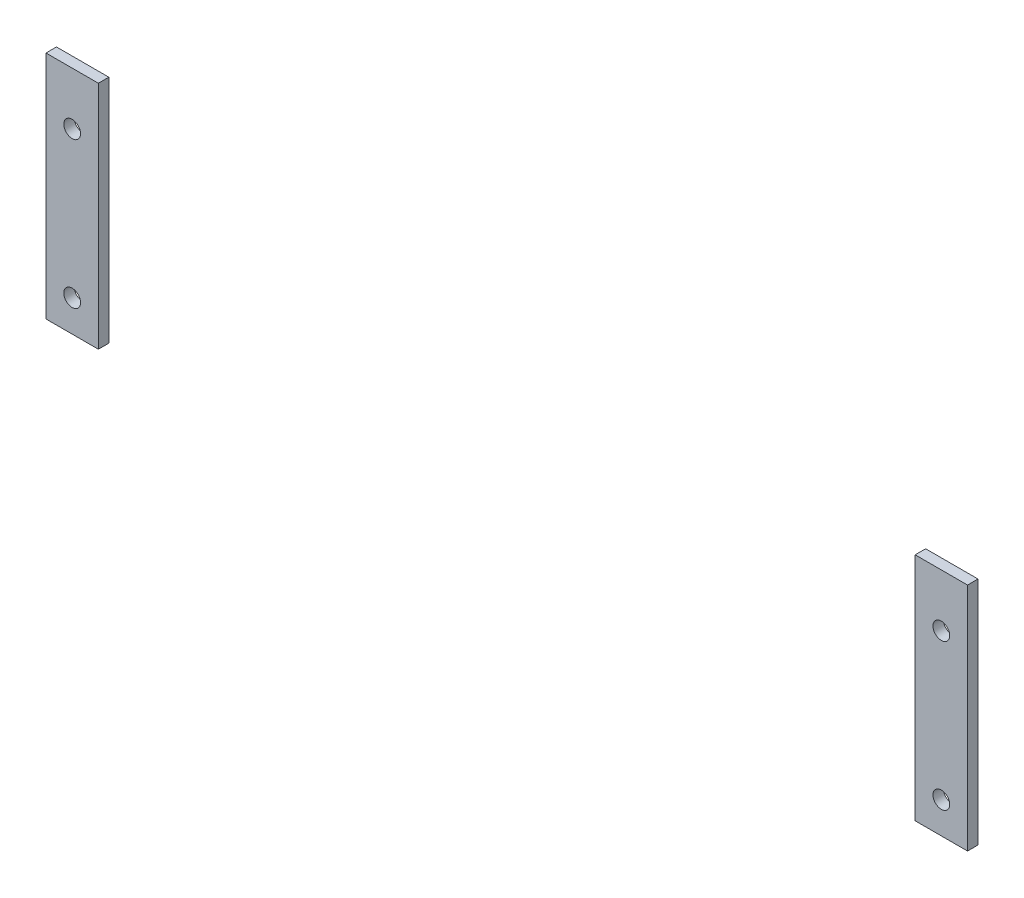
from build123d import *

# Parameters (mm, degrees)
ESQUISSE22_W         = 49.999952
ESQUISSE22_H         = 220.000029
ESQUISSE22_R         = 8
BOSS_EXTRU_1_DEPTH   = 10
BOSS_EXTRU_1_2_DEPTH = 10


with BuildPart() as part:
    # Esquisse22 → Boss.-Extru.1 (new body)
    with BuildSketch(Plane.XY.offset(9.99999)):
        with Locations((2166.999936, -1521.8299625)):
            Rectangle(ESQUISSE22_W, ESQUISSE22_H)
        with Locations((2167.000055, -1601.830006)):
            Circle(ESQUISSE22_R, mode=Mode.SUBTRACT)
        with Locations((2167.000055, -1462.159991)):
            Circle(ESQUISSE22_R, mode=Mode.SUBTRACT)
    extrude(amount=-BOSS_EXTRU_1_DEPTH)


with BuildPart() as body_2:
    # Esquisse22 → Boss.-Extru.1 2 (new body)
    with BuildSketch(Plane.XY.offset(9.99999)):
        with Locations((2997.000098, -1521.8299625)):
            Rectangle(ESQUISSE22_W, ESQUISSE22_H)
        with Locations((2996.999025, -1462.159991)):
            Circle(ESQUISSE22_R, mode=Mode.SUBTRACT)
        with Locations((2996.999025, -1601.830006)):
            Circle(ESQUISSE22_R, mode=Mode.SUBTRACT)
    extrude(amount=-BOSS_EXTRU_1_2_DEPTH)


solid = Compound([part.part, body_2.part])
